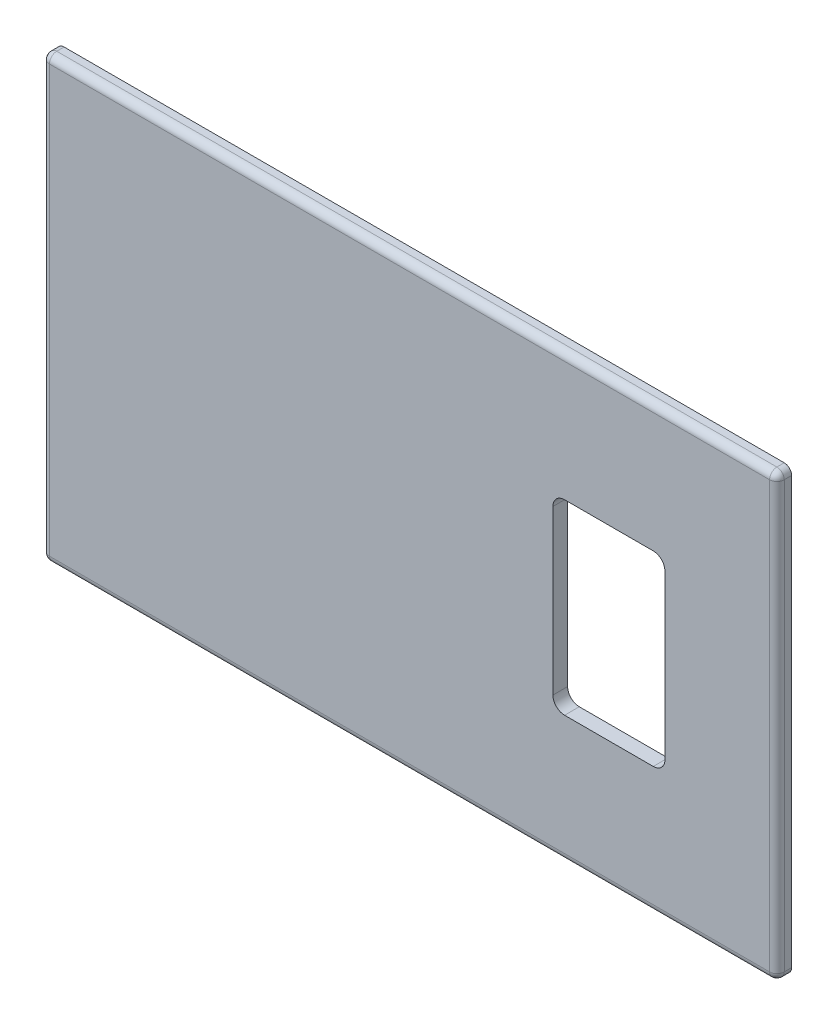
from build123d import *

# Parameters (mm, degrees)
SKETCH1_W           = 100
SKETCH1_H           = 60
BOSS_EXTRUDE1_DEPTH = 2
FILLET1_R           = 1
SKETCH2_W           = 15.24
SKETCH2_H           = 25.4
CUT_EXTRUDE1_DEPTH  = 59.343808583
FILLET2_R           = 1.5875


with BuildPart() as part:
    # Sketch1 → Boss-Extrude1 (new body)
    with BuildSketch(Plane.XY):
        Rectangle(SKETCH1_W, SKETCH1_H)
    extrude(amount=BOSS_EXTRUDE1_DEPTH)

    # Fillet1
    fillet1_edges = [part.edges().sort_by_distance(p)[0] for p in [
        (0, 30, 2),
        (-50, 0, 2),
        (0, -30, 2),
        (50, 0, 2),
        (-50, -30, 1),
        (-50, 30, 1),
        (50, 30, 1),
        (50, -30, 1),
    ]]
    fillet(fillet1_edges, radius=FILLET1_R)

    # Sketch2 → Cut-Extrude1 (cut, through all)
    with BuildSketch(Plane.XY.offset(2)):
        with Locations((27.14, 0)):
            Rectangle(SKETCH2_W, SKETCH2_H)
    extrude(amount=-CUT_EXTRUDE1_DEPTH, mode=Mode.SUBTRACT)

    # Fillet2
    fillet2_edges = [part.edges().sort_by_distance(p)[0] for p in [
        (19.52, -12.7, 1),
        (19.52, 12.7, 1),
        (34.76, 12.7, 1),
        (34.76, -12.7, 1),
    ]]
    fillet(fillet2_edges, radius=FILLET2_R)


solid = part.part
